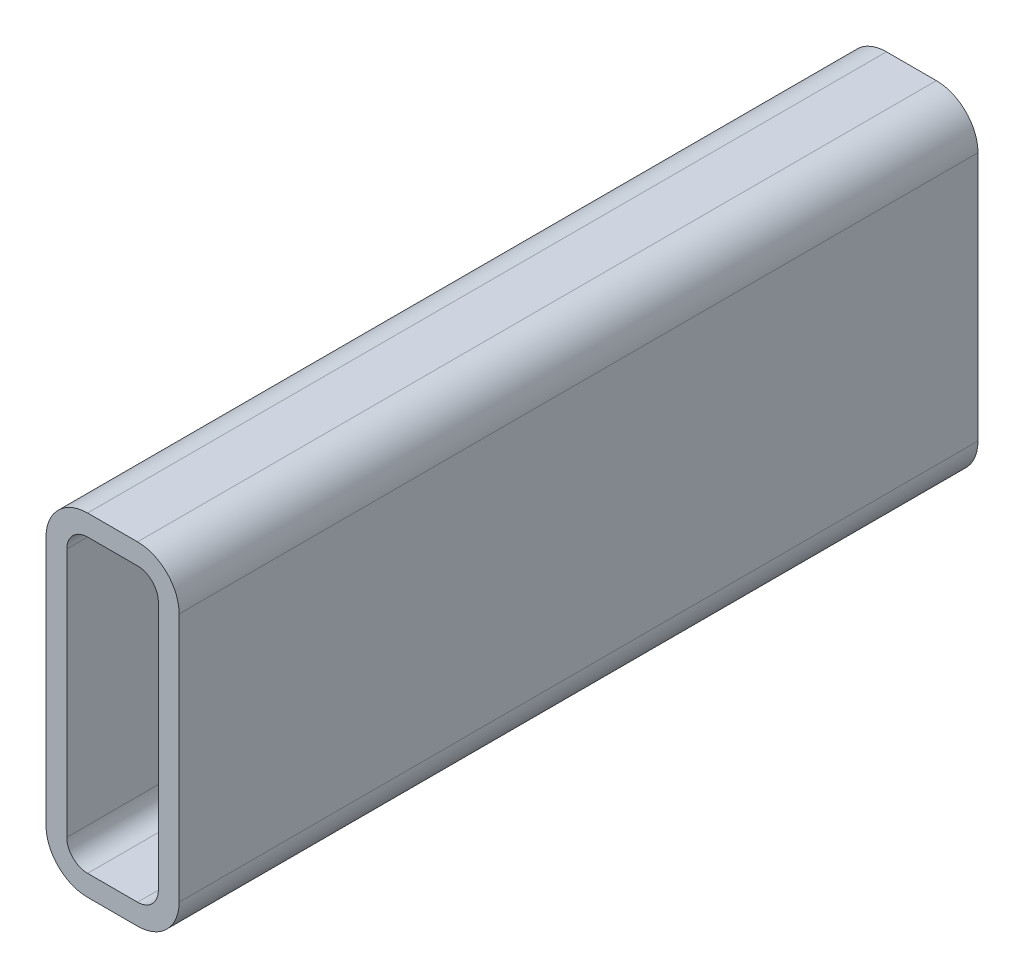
ISO-10303-21;
HEADER;
FILE_DESCRIPTION(('STEP AP214'),'2;1');
FILE_NAME('part.step','',(''),(''),'','','');
FILE_SCHEMA(('AUTOMOTIVE_DESIGN { 1 0 10303 214 1 1 1 1 }'));
ENDSEC;
DATA;
#1=APPLICATION_CONTEXT('core data for automotive mechanical design processes');
#2=APPLICATION_PROTOCOL_DEFINITION('international standard','automotive_design',2000,#1);
#3=PRODUCT_CONTEXT('',#1,'mechanical');
#4=PRODUCT('Part','Part','',(#3));
#5=PRODUCT_RELATED_PRODUCT_CATEGORY('part','',(#4));
#6=PRODUCT_DEFINITION_FORMATION('','',#4);
#7=PRODUCT_DEFINITION_CONTEXT('part definition',#1,'design');
#8=PRODUCT_DEFINITION('design','',#6,#7);
#9=PRODUCT_DEFINITION_SHAPE('','',#8);
#10=(LENGTH_UNIT() NAMED_UNIT(*) SI_UNIT(.MILLI.,.METRE.));
#11=(NAMED_UNIT(*) PLANE_ANGLE_UNIT() SI_UNIT($,.RADIAN.));
#12=(NAMED_UNIT(*) SI_UNIT($,.STERADIAN.) SOLID_ANGLE_UNIT());
#13=UNCERTAINTY_MEASURE_WITH_UNIT(LENGTH_MEASURE(1.E-05),#10,'distance_accuracy_value','');
#14=(GEOMETRIC_REPRESENTATION_CONTEXT(3) GLOBAL_UNCERTAINTY_ASSIGNED_CONTEXT((#13)) GLOBAL_UNIT_ASSIGNED_CONTEXT((#10,
#11,#12)) REPRESENTATION_CONTEXT('',''));
#15=CARTESIAN_POINT('',(0.,0.,0.));
#16=DIRECTION('',(0.,0.,1.));
#17=DIRECTION('',(1.,0.,0.));
#18=AXIS2_PLACEMENT_3D('',#15,#16,#17);
#19=CARTESIAN_POINT('',(15.875,111.125,304.8));
#20=DIRECTION('',(0.,0.,1.));
#21=DIRECTION('',(1.,0.,0.));
#22=AXIS2_PLACEMENT_3D('',#19,#20,#21);
#23=PLANE('',#22);
#24=CARTESIAN_POINT('',(15.875,111.125,304.8));
#25=DIRECTION('',(0.,0.,1.));
#26=DIRECTION('',(1.,0.,0.));
#27=AXIS2_PLACEMENT_3D('',#24,#25,#26);
#28=CIRCLE('',#27,15.875);
#29=CARTESIAN_POINT('',(15.875,127.,304.8));
#30=VERTEX_POINT('',#29);
#31=CARTESIAN_POINT('',(0.,111.125,304.8));
#32=VERTEX_POINT('',#31);
#33=EDGE_CURVE('E211',#30,#32,#28,.T.);
#34=ORIENTED_EDGE('',*,*,#33,.T.);
#35=DIRECTION('',(0.,-1.,0.));
#36=VECTOR('',#35,1.);
#37=CARTESIAN_POINT('',(0.,15.875,304.8));
#38=LINE('',#37,#36);
#39=CARTESIAN_POINT('',(0.,15.875,304.8));
#40=VERTEX_POINT('',#39);
#41=EDGE_CURVE('E214',#32,#40,#38,.T.);
#42=ORIENTED_EDGE('',*,*,#41,.T.);
#43=CARTESIAN_POINT('',(15.875,15.875,304.8));
#44=DIRECTION('',(0.,0.,1.));
#45=DIRECTION('',(1.,0.,0.));
#46=AXIS2_PLACEMENT_3D('',#43,#44,#45);
#47=CIRCLE('',#46,15.875);
#48=CARTESIAN_POINT('',(15.875,0.,304.8));
#49=VERTEX_POINT('',#48);
#50=EDGE_CURVE('E217',#40,#49,#47,.T.);
#51=ORIENTED_EDGE('',*,*,#50,.T.);
#52=DIRECTION('',(1.,0.,0.));
#53=VECTOR('',#52,1.);
#54=CARTESIAN_POINT('',(34.925,0.,304.8));
#55=LINE('',#54,#53);
#56=CARTESIAN_POINT('',(34.925,0.,304.8));
#57=VERTEX_POINT('',#56);
#58=EDGE_CURVE('E219',#49,#57,#55,.T.);
#59=ORIENTED_EDGE('',*,*,#58,.T.);
#60=CARTESIAN_POINT('',(34.925,15.875,304.8));
#61=DIRECTION('',(0.,0.,1.));
#62=DIRECTION('',(1.,0.,0.));
#63=AXIS2_PLACEMENT_3D('',#60,#61,#62);
#64=CIRCLE('',#63,15.875);
#65=CARTESIAN_POINT('',(50.8,15.875,304.8));
#66=VERTEX_POINT('',#65);
#67=EDGE_CURVE('E221',#57,#66,#64,.T.);
#68=ORIENTED_EDGE('',*,*,#67,.T.);
#69=DIRECTION('',(0.,1.,0.));
#70=VECTOR('',#69,1.);
#71=CARTESIAN_POINT('',(50.8,111.125,304.8));
#72=LINE('',#71,#70);
#73=CARTESIAN_POINT('',(50.8,111.125,304.8));
#74=VERTEX_POINT('',#73);
#75=EDGE_CURVE('E223',#66,#74,#72,.T.);
#76=ORIENTED_EDGE('',*,*,#75,.T.);
#77=CARTESIAN_POINT('',(34.925,111.125,304.8));
#78=DIRECTION('',(0.,0.,1.));
#79=DIRECTION('',(1.,0.,0.));
#80=AXIS2_PLACEMENT_3D('',#77,#78,#79);
#81=CIRCLE('',#80,15.875);
#82=CARTESIAN_POINT('',(34.925,127.,304.8));
#83=VERTEX_POINT('',#82);
#84=EDGE_CURVE('E225',#74,#83,#81,.T.);
#85=ORIENTED_EDGE('',*,*,#84,.T.);
#86=DIRECTION('',(-1.,0.,0.));
#87=VECTOR('',#86,1.);
#88=CARTESIAN_POINT('',(15.875,127.,304.8));
#89=LINE('',#88,#87);
#90=EDGE_CURVE('E227',#83,#30,#89,.T.);
#91=ORIENTED_EDGE('',*,*,#90,.T.);
#92=EDGE_LOOP('',(#34,#42,#51,#59,#68,#76,#85,#91));
#93=FACE_BOUND('',#92,.T.);
#94=DIRECTION('',(0.,-1.,0.));
#95=VECTOR('',#94,1.);
#96=CARTESIAN_POINT('',(7.9375,15.875,304.8));
#97=LINE('',#96,#95);
#98=CARTESIAN_POINT('',(7.9375,111.125,304.8));
#99=VERTEX_POINT('',#98);
#100=CARTESIAN_POINT('',(7.9375,15.875,304.8));
#101=VERTEX_POINT('',#100);
#102=EDGE_CURVE('E154',#99,#101,#97,.T.);
#103=ORIENTED_EDGE('',*,*,#102,.F.);
#104=CARTESIAN_POINT('',(15.875,111.125,304.8));
#105=DIRECTION('',(0.,0.,1.));
#106=DIRECTION('',(1.,0.,0.));
#107=AXIS2_PLACEMENT_3D('',#104,#105,#106);
#108=CIRCLE('',#107,7.93749999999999);
#109=CARTESIAN_POINT('',(15.875,119.0625,304.8));
#110=VERTEX_POINT('',#109);
#111=EDGE_CURVE('E146',#110,#99,#108,.T.);
#112=ORIENTED_EDGE('',*,*,#111,.F.);
#113=DIRECTION('',(-1.,0.,0.));
#114=VECTOR('',#113,1.);
#115=CARTESIAN_POINT('',(15.875,119.0625,304.8));
#116=LINE('',#115,#114);
#117=CARTESIAN_POINT('',(34.925,119.0625,304.8));
#118=VERTEX_POINT('',#117);
#119=EDGE_CURVE('E179',#118,#110,#116,.T.);
#120=ORIENTED_EDGE('',*,*,#119,.F.);
#121=CARTESIAN_POINT('',(34.925,111.125,304.8));
#122=DIRECTION('',(0.,0.,1.));
#123=DIRECTION('',(1.,0.,0.));
#124=AXIS2_PLACEMENT_3D('',#121,#122,#123);
#125=CIRCLE('',#124,7.93749999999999);
#126=CARTESIAN_POINT('',(42.8625,111.125,304.8));
#127=VERTEX_POINT('',#126);
#128=EDGE_CURVE('E177',#127,#118,#125,.T.);
#129=ORIENTED_EDGE('',*,*,#128,.F.);
#130=DIRECTION('',(0.,1.,0.));
#131=VECTOR('',#130,1.);
#132=CARTESIAN_POINT('',(42.8625,111.125,304.8));
#133=LINE('',#132,#131);
#134=CARTESIAN_POINT('',(42.8625,15.875,304.8));
#135=VERTEX_POINT('',#134);
#136=EDGE_CURVE('E175',#135,#127,#133,.T.);
#137=ORIENTED_EDGE('',*,*,#136,.F.);
#138=CARTESIAN_POINT('',(34.925,15.875,304.8));
#139=DIRECTION('',(0.,0.,1.));
#140=DIRECTION('',(1.,0.,0.));
#141=AXIS2_PLACEMENT_3D('',#138,#139,#140);
#142=CIRCLE('',#141,7.9375);
#143=CARTESIAN_POINT('',(34.925,7.9375,304.8));
#144=VERTEX_POINT('',#143);
#145=EDGE_CURVE('E173',#144,#135,#142,.T.);
#146=ORIENTED_EDGE('',*,*,#145,.F.);
#147=DIRECTION('',(1.,0.,0.));
#148=VECTOR('',#147,1.);
#149=CARTESIAN_POINT('',(34.925,7.9375,304.8));
#150=LINE('',#149,#148);
#151=CARTESIAN_POINT('',(15.875,7.9375,304.8));
#152=VERTEX_POINT('',#151);
#153=EDGE_CURVE('E169',#152,#144,#150,.T.);
#154=ORIENTED_EDGE('',*,*,#153,.F.);
#155=CARTESIAN_POINT('',(15.875,15.875,304.8));
#156=DIRECTION('',(0.,0.,1.));
#157=DIRECTION('',(1.,0.,0.));
#158=AXIS2_PLACEMENT_3D('',#155,#156,#157);
#159=CIRCLE('',#158,7.9375);
#160=EDGE_CURVE('E167',#101,#152,#159,.T.);
#161=ORIENTED_EDGE('',*,*,#160,.F.);
#162=EDGE_LOOP('',(#103,#112,#120,#129,#137,#146,#154,#161));
#163=FACE_BOUND('',#162,.T.);
#164=ADVANCED_FACE('F33',(#93,#163),#23,.T.);
#165=CARTESIAN_POINT('',(15.875,111.125,0.));
#166=DIRECTION('',(0.,0.,1.));
#167=DIRECTION('',(1.,0.,0.));
#168=AXIS2_PLACEMENT_3D('',#165,#166,#167);
#169=PLANE('',#168);
#170=CARTESIAN_POINT('',(15.875,111.125,0.));
#171=DIRECTION('',(0.,0.,1.));
#172=DIRECTION('',(1.,0.,0.));
#173=AXIS2_PLACEMENT_3D('',#170,#171,#172);
#174=CIRCLE('',#173,15.875);
#175=CARTESIAN_POINT('',(15.875,127.,0.));
#176=VERTEX_POINT('',#175);
#177=CARTESIAN_POINT('',(0.,111.125,0.));
#178=VERTEX_POINT('',#177);
#179=EDGE_CURVE('E162',#176,#178,#174,.T.);
#180=ORIENTED_EDGE('',*,*,#179,.F.);
#181=DIRECTION('',(-1.,0.,0.));
#182=VECTOR('',#181,1.);
#183=CARTESIAN_POINT('',(15.875,127.,0.));
#184=LINE('',#183,#182);
#185=CARTESIAN_POINT('',(34.925,127.,0.));
#186=VERTEX_POINT('',#185);
#187=EDGE_CURVE('E215',#186,#176,#184,.T.);
#188=ORIENTED_EDGE('',*,*,#187,.F.);
#189=CARTESIAN_POINT('',(34.925,111.125,0.));
#190=DIRECTION('',(0.,0.,1.));
#191=DIRECTION('',(1.,0.,0.));
#192=AXIS2_PLACEMENT_3D('',#189,#190,#191);
#193=CIRCLE('',#192,15.875);
#194=CARTESIAN_POINT('',(50.8,111.125,0.));
#195=VERTEX_POINT('',#194);
#196=EDGE_CURVE('E242',#195,#186,#193,.T.);
#197=ORIENTED_EDGE('',*,*,#196,.F.);
#198=DIRECTION('',(0.,1.,0.));
#199=VECTOR('',#198,1.);
#200=CARTESIAN_POINT('',(50.8,111.125,0.));
#201=LINE('',#200,#199);
#202=CARTESIAN_POINT('',(50.8,15.875,0.));
#203=VERTEX_POINT('',#202);
#204=EDGE_CURVE('E240',#203,#195,#201,.T.);
#205=ORIENTED_EDGE('',*,*,#204,.F.);
#206=CARTESIAN_POINT('',(34.925,15.875,0.));
#207=DIRECTION('',(0.,0.,1.));
#208=DIRECTION('',(1.,0.,0.));
#209=AXIS2_PLACEMENT_3D('',#206,#207,#208);
#210=CIRCLE('',#209,15.875);
#211=CARTESIAN_POINT('',(34.925,0.,0.));
#212=VERTEX_POINT('',#211);
#213=EDGE_CURVE('E238',#212,#203,#210,.T.);
#214=ORIENTED_EDGE('',*,*,#213,.F.);
#215=DIRECTION('',(1.,0.,0.));
#216=VECTOR('',#215,1.);
#217=CARTESIAN_POINT('',(34.925,0.,0.));
#218=LINE('',#217,#216);
#219=CARTESIAN_POINT('',(15.875,0.,0.));
#220=VERTEX_POINT('',#219);
#221=EDGE_CURVE('E236',#220,#212,#218,.T.);
#222=ORIENTED_EDGE('',*,*,#221,.F.);
#223=CARTESIAN_POINT('',(15.875,15.875,0.));
#224=DIRECTION('',(0.,0.,1.));
#225=DIRECTION('',(1.,0.,0.));
#226=AXIS2_PLACEMENT_3D('',#223,#224,#225);
#227=CIRCLE('',#226,15.875);
#228=CARTESIAN_POINT('',(0.,15.875,0.));
#229=VERTEX_POINT('',#228);
#230=EDGE_CURVE('E234',#229,#220,#227,.T.);
#231=ORIENTED_EDGE('',*,*,#230,.F.);
#232=DIRECTION('',(0.,-1.,0.));
#233=VECTOR('',#232,1.);
#234=CARTESIAN_POINT('',(0.,15.875,0.));
#235=LINE('',#234,#233);
#236=EDGE_CURVE('E232',#178,#229,#235,.T.);
#237=ORIENTED_EDGE('',*,*,#236,.F.);
#238=EDGE_LOOP('',(#180,#188,#197,#205,#214,#222,#231,#237));
#239=FACE_BOUND('',#238,.T.);
#240=CARTESIAN_POINT('',(15.875,111.125,0.));
#241=DIRECTION('',(0.,0.,1.));
#242=DIRECTION('',(1.,0.,0.));
#243=AXIS2_PLACEMENT_3D('',#240,#241,#242);
#244=CIRCLE('',#243,7.93749999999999);
#245=CARTESIAN_POINT('',(15.875,119.0625,0.));
#246=VERTEX_POINT('',#245);
#247=CARTESIAN_POINT('',(7.9375,111.125,0.));
#248=VERTEX_POINT('',#247);
#249=EDGE_CURVE('E56',#246,#248,#244,.T.);
#250=ORIENTED_EDGE('',*,*,#249,.T.);
#251=DIRECTION('',(0.,-1.,0.));
#252=VECTOR('',#251,1.);
#253=CARTESIAN_POINT('',(7.9375,15.875,0.));
#254=LINE('',#253,#252);
#255=CARTESIAN_POINT('',(7.9375,15.875,0.));
#256=VERTEX_POINT('',#255);
#257=EDGE_CURVE('E161',#248,#256,#254,.T.);
#258=ORIENTED_EDGE('',*,*,#257,.T.);
#259=CARTESIAN_POINT('',(15.875,15.875,0.));
#260=DIRECTION('',(0.,0.,1.));
#261=DIRECTION('',(1.,0.,0.));
#262=AXIS2_PLACEMENT_3D('',#259,#260,#261);
#263=CIRCLE('',#262,7.9375);
#264=CARTESIAN_POINT('',(15.875,7.9375,0.));
#265=VERTEX_POINT('',#264);
#266=EDGE_CURVE('E183',#256,#265,#263,.T.);
#267=ORIENTED_EDGE('',*,*,#266,.T.);
#268=DIRECTION('',(1.,0.,0.));
#269=VECTOR('',#268,1.);
#270=CARTESIAN_POINT('',(34.925,7.9375,0.));
#271=LINE('',#270,#269);
#272=CARTESIAN_POINT('',(34.925,7.9375,0.));
#273=VERTEX_POINT('',#272);
#274=EDGE_CURVE('E186',#265,#273,#271,.T.);
#275=ORIENTED_EDGE('',*,*,#274,.T.);
#276=CARTESIAN_POINT('',(34.925,15.875,0.));
#277=DIRECTION('',(0.,0.,1.));
#278=DIRECTION('',(1.,0.,0.));
#279=AXIS2_PLACEMENT_3D('',#276,#277,#278);
#280=CIRCLE('',#279,7.9375);
#281=CARTESIAN_POINT('',(42.8625,15.875,0.));
#282=VERTEX_POINT('',#281);
#283=EDGE_CURVE('E189',#273,#282,#280,.T.);
#284=ORIENTED_EDGE('',*,*,#283,.T.);
#285=DIRECTION('',(0.,1.,0.));
#286=VECTOR('',#285,1.);
#287=CARTESIAN_POINT('',(42.8625,111.125,0.));
#288=LINE('',#287,#286);
#289=CARTESIAN_POINT('',(42.8625,111.125,0.));
#290=VERTEX_POINT('',#289);
#291=EDGE_CURVE('E192',#282,#290,#288,.T.);
#292=ORIENTED_EDGE('',*,*,#291,.T.);
#293=CARTESIAN_POINT('',(34.925,111.125,0.));
#294=DIRECTION('',(0.,0.,1.));
#295=DIRECTION('',(1.,0.,0.));
#296=AXIS2_PLACEMENT_3D('',#293,#294,#295);
#297=CIRCLE('',#296,7.93749999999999);
#298=CARTESIAN_POINT('',(34.925,119.0625,0.));
#299=VERTEX_POINT('',#298);
#300=EDGE_CURVE('E195',#290,#299,#297,.T.);
#301=ORIENTED_EDGE('',*,*,#300,.T.);
#302=DIRECTION('',(-1.,0.,0.));
#303=VECTOR('',#302,1.);
#304=CARTESIAN_POINT('',(15.875,119.0625,0.));
#305=LINE('',#304,#303);
#306=EDGE_CURVE('E155',#299,#246,#305,.T.);
#307=ORIENTED_EDGE('',*,*,#306,.T.);
#308=EDGE_LOOP('',(#250,#258,#267,#275,#284,#292,#301,#307));
#309=FACE_BOUND('',#308,.T.);
#310=ADVANCED_FACE('F272',(#239,#309),#169,.F.);
#311=CARTESIAN_POINT('',(15.875,111.125,304.8));
#312=DIRECTION('',(0.,0.,-1.));
#313=DIRECTION('',(-1.,0.,0.));
#314=AXIS2_PLACEMENT_3D('',#311,#312,#313);
#315=CYLINDRICAL_SURFACE('',#314,15.875);
#316=ORIENTED_EDGE('',*,*,#179,.T.);
#317=DIRECTION('',(0.,0.,-1.));
#318=VECTOR('',#317,1.);
#319=CARTESIAN_POINT('',(0.,111.125,304.8));
#320=LINE('',#319,#318);
#321=EDGE_CURVE('E11',#32,#178,#320,.T.);
#322=ORIENTED_EDGE('',*,*,#321,.F.);
#323=ORIENTED_EDGE('',*,*,#33,.F.);
#324=DIRECTION('',(0.,0.,-1.));
#325=VECTOR('',#324,1.);
#326=CARTESIAN_POINT('',(15.875,127.,304.8));
#327=LINE('',#326,#325);
#328=EDGE_CURVE('E229',#30,#176,#327,.T.);
#329=ORIENTED_EDGE('',*,*,#328,.T.);
#330=EDGE_LOOP('',(#316,#322,#323,#329));
#331=FACE_BOUND('',#330,.T.);
#332=ADVANCED_FACE('F35',(#331),#315,.T.);
#333=CARTESIAN_POINT('',(0.,15.875,304.8));
#334=DIRECTION('',(1.,0.,0.));
#335=DIRECTION('',(0.,0.,-1.));
#336=AXIS2_PLACEMENT_3D('',#333,#334,#335);
#337=PLANE('',#336);
#338=ORIENTED_EDGE('',*,*,#236,.T.);
#339=DIRECTION('',(0.,0.,-1.));
#340=VECTOR('',#339,1.);
#341=CARTESIAN_POINT('',(0.,15.875,304.8));
#342=LINE('',#341,#340);
#343=EDGE_CURVE('E41',#40,#229,#342,.T.);
#344=ORIENTED_EDGE('',*,*,#343,.F.);
#345=ORIENTED_EDGE('',*,*,#41,.F.);
#346=ORIENTED_EDGE('',*,*,#321,.T.);
#347=EDGE_LOOP('',(#338,#344,#345,#346));
#348=FACE_BOUND('',#347,.T.);
#349=ADVANCED_FACE('F289',(#348),#337,.F.);
#350=CARTESIAN_POINT('',(15.875,15.875,304.8));
#351=DIRECTION('',(0.,0.,-1.));
#352=DIRECTION('',(-1.,0.,0.));
#353=AXIS2_PLACEMENT_3D('',#350,#351,#352);
#354=CYLINDRICAL_SURFACE('',#353,15.875);
#355=ORIENTED_EDGE('',*,*,#230,.T.);
#356=DIRECTION('',(0.,0.,-1.));
#357=VECTOR('',#356,1.);
#358=CARTESIAN_POINT('',(15.875,0.,304.8));
#359=LINE('',#358,#357);
#360=EDGE_CURVE('E259',#49,#220,#359,.T.);
#361=ORIENTED_EDGE('',*,*,#360,.F.);
#362=ORIENTED_EDGE('',*,*,#50,.F.);
#363=ORIENTED_EDGE('',*,*,#343,.T.);
#364=EDGE_LOOP('',(#355,#361,#362,#363));
#365=FACE_BOUND('',#364,.T.);
#366=ADVANCED_FACE('F266',(#365),#354,.T.);
#367=CARTESIAN_POINT('',(34.925,0.,304.8));
#368=DIRECTION('',(0.,1.,0.));
#369=DIRECTION('',(0.,0.,1.));
#370=AXIS2_PLACEMENT_3D('',#367,#368,#369);
#371=PLANE('',#370);
#372=ORIENTED_EDGE('',*,*,#221,.T.);
#373=DIRECTION('',(0.,0.,-1.));
#374=VECTOR('',#373,1.);
#375=CARTESIAN_POINT('',(34.925,0.,304.8));
#376=LINE('',#375,#374);
#377=EDGE_CURVE('E256',#57,#212,#376,.T.);
#378=ORIENTED_EDGE('',*,*,#377,.F.);
#379=ORIENTED_EDGE('',*,*,#58,.F.);
#380=ORIENTED_EDGE('',*,*,#360,.T.);
#381=EDGE_LOOP('',(#372,#378,#379,#380));
#382=FACE_BOUND('',#381,.T.);
#383=ADVANCED_FACE('F278',(#382),#371,.F.);
#384=CARTESIAN_POINT('',(34.925,15.875,304.8));
#385=DIRECTION('',(0.,0.,-1.));
#386=DIRECTION('',(-1.,0.,0.));
#387=AXIS2_PLACEMENT_3D('',#384,#385,#386);
#388=CYLINDRICAL_SURFACE('',#387,15.875);
#389=ORIENTED_EDGE('',*,*,#213,.T.);
#390=DIRECTION('',(0.,0.,-1.));
#391=VECTOR('',#390,1.);
#392=CARTESIAN_POINT('',(50.8,15.875,304.8));
#393=LINE('',#392,#391);
#394=EDGE_CURVE('E253',#66,#203,#393,.T.);
#395=ORIENTED_EDGE('',*,*,#394,.F.);
#396=ORIENTED_EDGE('',*,*,#67,.F.);
#397=ORIENTED_EDGE('',*,*,#377,.T.);
#398=EDGE_LOOP('',(#389,#395,#396,#397));
#399=FACE_BOUND('',#398,.T.);
#400=ADVANCED_FACE('F282',(#399),#388,.T.);
#401=CARTESIAN_POINT('',(50.8,111.125,304.8));
#402=DIRECTION('',(-1.,0.,0.));
#403=DIRECTION('',(0.,0.,1.));
#404=AXIS2_PLACEMENT_3D('',#401,#402,#403);
#405=PLANE('',#404);
#406=ORIENTED_EDGE('',*,*,#204,.T.);
#407=DIRECTION('',(0.,0.,-1.));
#408=VECTOR('',#407,1.);
#409=CARTESIAN_POINT('',(50.8,111.125,304.8));
#410=LINE('',#409,#408);
#411=EDGE_CURVE('E250',#74,#195,#410,.T.);
#412=ORIENTED_EDGE('',*,*,#411,.F.);
#413=ORIENTED_EDGE('',*,*,#75,.F.);
#414=ORIENTED_EDGE('',*,*,#394,.T.);
#415=EDGE_LOOP('',(#406,#412,#413,#414));
#416=FACE_BOUND('',#415,.T.);
#417=ADVANCED_FACE('F302',(#416),#405,.F.);
#418=CARTESIAN_POINT('',(34.925,111.125,304.8));
#419=DIRECTION('',(0.,0.,-1.));
#420=DIRECTION('',(-1.,0.,0.));
#421=AXIS2_PLACEMENT_3D('',#418,#419,#420);
#422=CYLINDRICAL_SURFACE('',#421,15.875);
#423=ORIENTED_EDGE('',*,*,#196,.T.);
#424=DIRECTION('',(0.,0.,-1.));
#425=VECTOR('',#424,1.);
#426=CARTESIAN_POINT('',(34.925,127.,304.8));
#427=LINE('',#426,#425);
#428=EDGE_CURVE('E247',#83,#186,#427,.T.);
#429=ORIENTED_EDGE('',*,*,#428,.F.);
#430=ORIENTED_EDGE('',*,*,#84,.F.);
#431=ORIENTED_EDGE('',*,*,#411,.T.);
#432=EDGE_LOOP('',(#423,#429,#430,#431));
#433=FACE_BOUND('',#432,.T.);
#434=ADVANCED_FACE('F300',(#433),#422,.T.);
#435=CARTESIAN_POINT('',(15.875,127.,304.8));
#436=DIRECTION('',(0.,-1.,0.));
#437=DIRECTION('',(0.,0.,-1.));
#438=AXIS2_PLACEMENT_3D('',#435,#436,#437);
#439=PLANE('',#438);
#440=ORIENTED_EDGE('',*,*,#187,.T.);
#441=ORIENTED_EDGE('',*,*,#328,.F.);
#442=ORIENTED_EDGE('',*,*,#90,.F.);
#443=ORIENTED_EDGE('',*,*,#428,.T.);
#444=EDGE_LOOP('',(#440,#441,#442,#443));
#445=FACE_BOUND('',#444,.T.);
#446=ADVANCED_FACE('F295',(#445),#439,.F.);
#447=CARTESIAN_POINT('',(15.875,111.125,304.8));
#448=DIRECTION('',(0.,0.,-1.));
#449=DIRECTION('',(-1.,0.,0.));
#450=AXIS2_PLACEMENT_3D('',#447,#448,#449);
#451=CYLINDRICAL_SURFACE('',#450,7.93749999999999);
#452=ORIENTED_EDGE('',*,*,#249,.F.);
#453=DIRECTION('',(0.,0.,-1.));
#454=VECTOR('',#453,1.);
#455=CARTESIAN_POINT('',(15.875,119.0625,304.8));
#456=LINE('',#455,#454);
#457=EDGE_CURVE('E150',#110,#246,#456,.T.);
#458=ORIENTED_EDGE('',*,*,#457,.F.);
#459=ORIENTED_EDGE('',*,*,#111,.T.);
#460=DIRECTION('',(0.,0.,-1.));
#461=VECTOR('',#460,1.);
#462=CARTESIAN_POINT('',(7.9375,111.125,304.8));
#463=LINE('',#462,#461);
#464=EDGE_CURVE('E149',#99,#248,#463,.T.);
#465=ORIENTED_EDGE('',*,*,#464,.T.);
#466=EDGE_LOOP('',(#452,#458,#459,#465));
#467=FACE_BOUND('',#466,.T.);
#468=ADVANCED_FACE('F148',(#467),#451,.F.);
#469=CARTESIAN_POINT('',(7.9375,15.875,304.8));
#470=DIRECTION('',(1.,0.,0.));
#471=DIRECTION('',(0.,0.,-1.));
#472=AXIS2_PLACEMENT_3D('',#469,#470,#471);
#473=PLANE('',#472);
#474=ORIENTED_EDGE('',*,*,#257,.F.);
#475=ORIENTED_EDGE('',*,*,#464,.F.);
#476=ORIENTED_EDGE('',*,*,#102,.T.);
#477=DIRECTION('',(0.,0.,-1.));
#478=VECTOR('',#477,1.);
#479=CARTESIAN_POINT('',(7.9375,15.875,304.8));
#480=LINE('',#479,#478);
#481=EDGE_CURVE('E163',#101,#256,#480,.T.);
#482=ORIENTED_EDGE('',*,*,#481,.T.);
#483=EDGE_LOOP('',(#474,#475,#476,#482));
#484=FACE_BOUND('',#483,.T.);
#485=ADVANCED_FACE('F158',(#484),#473,.T.);
#486=CARTESIAN_POINT('',(15.875,15.875,304.8));
#487=DIRECTION('',(0.,0.,-1.));
#488=DIRECTION('',(-1.,0.,0.));
#489=AXIS2_PLACEMENT_3D('',#486,#487,#488);
#490=CYLINDRICAL_SURFACE('',#489,7.9375);
#491=ORIENTED_EDGE('',*,*,#266,.F.);
#492=ORIENTED_EDGE('',*,*,#481,.F.);
#493=ORIENTED_EDGE('',*,*,#160,.T.);
#494=DIRECTION('',(0.,0.,-1.));
#495=VECTOR('',#494,1.);
#496=CARTESIAN_POINT('',(15.875,7.9375,304.8));
#497=LINE('',#496,#495);
#498=EDGE_CURVE('E208',#152,#265,#497,.T.);
#499=ORIENTED_EDGE('',*,*,#498,.T.);
#500=EDGE_LOOP('',(#491,#492,#493,#499));
#501=FACE_BOUND('',#500,.T.);
#502=ADVANCED_FACE('F327',(#501),#490,.F.);
#503=CARTESIAN_POINT('',(34.925,7.9375,304.8));
#504=DIRECTION('',(0.,1.,0.));
#505=DIRECTION('',(0.,0.,1.));
#506=AXIS2_PLACEMENT_3D('',#503,#504,#505);
#507=PLANE('',#506);
#508=ORIENTED_EDGE('',*,*,#274,.F.);
#509=ORIENTED_EDGE('',*,*,#498,.F.);
#510=ORIENTED_EDGE('',*,*,#153,.T.);
#511=DIRECTION('',(0.,0.,-1.));
#512=VECTOR('',#511,1.);
#513=CARTESIAN_POINT('',(34.925,7.9375,304.8));
#514=LINE('',#513,#512);
#515=EDGE_CURVE('E206',#144,#273,#514,.T.);
#516=ORIENTED_EDGE('',*,*,#515,.T.);
#517=EDGE_LOOP('',(#508,#509,#510,#516));
#518=FACE_BOUND('',#517,.T.);
#519=ADVANCED_FACE('F331',(#518),#507,.T.);
#520=CARTESIAN_POINT('',(34.925,15.875,304.8));
#521=DIRECTION('',(0.,0.,-1.));
#522=DIRECTION('',(-1.,0.,0.));
#523=AXIS2_PLACEMENT_3D('',#520,#521,#522);
#524=CYLINDRICAL_SURFACE('',#523,7.9375);
#525=ORIENTED_EDGE('',*,*,#283,.F.);
#526=ORIENTED_EDGE('',*,*,#515,.F.);
#527=ORIENTED_EDGE('',*,*,#145,.T.);
#528=DIRECTION('',(0.,0.,-1.));
#529=VECTOR('',#528,1.);
#530=CARTESIAN_POINT('',(42.8625,15.875,304.8));
#531=LINE('',#530,#529);
#532=EDGE_CURVE('E204',#135,#282,#531,.T.);
#533=ORIENTED_EDGE('',*,*,#532,.T.);
#534=EDGE_LOOP('',(#525,#526,#527,#533));
#535=FACE_BOUND('',#534,.T.);
#536=ADVANCED_FACE('F337',(#535),#524,.F.);
#537=CARTESIAN_POINT('',(42.8625,111.125,304.8));
#538=DIRECTION('',(-1.,0.,0.));
#539=DIRECTION('',(0.,0.,1.));
#540=AXIS2_PLACEMENT_3D('',#537,#538,#539);
#541=PLANE('',#540);
#542=ORIENTED_EDGE('',*,*,#291,.F.);
#543=ORIENTED_EDGE('',*,*,#532,.F.);
#544=ORIENTED_EDGE('',*,*,#136,.T.);
#545=DIRECTION('',(0.,0.,-1.));
#546=VECTOR('',#545,1.);
#547=CARTESIAN_POINT('',(42.8625,111.125,304.8));
#548=LINE('',#547,#546);
#549=EDGE_CURVE('E202',#127,#290,#548,.T.);
#550=ORIENTED_EDGE('',*,*,#549,.T.);
#551=EDGE_LOOP('',(#542,#543,#544,#550));
#552=FACE_BOUND('',#551,.T.);
#553=ADVANCED_FACE('F341',(#552),#541,.T.);
#554=CARTESIAN_POINT('',(34.925,111.125,304.8));
#555=DIRECTION('',(0.,0.,-1.));
#556=DIRECTION('',(-1.,0.,0.));
#557=AXIS2_PLACEMENT_3D('',#554,#555,#556);
#558=CYLINDRICAL_SURFACE('',#557,7.93749999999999);
#559=ORIENTED_EDGE('',*,*,#300,.F.);
#560=ORIENTED_EDGE('',*,*,#549,.F.);
#561=ORIENTED_EDGE('',*,*,#128,.T.);
#562=DIRECTION('',(0.,0.,-1.));
#563=VECTOR('',#562,1.);
#564=CARTESIAN_POINT('',(34.925,119.0625,304.8));
#565=LINE('',#564,#563);
#566=EDGE_CURVE('E48',#118,#299,#565,.T.);
#567=ORIENTED_EDGE('',*,*,#566,.T.);
#568=EDGE_LOOP('',(#559,#560,#561,#567));
#569=FACE_BOUND('',#568,.T.);
#570=ADVANCED_FACE('F345',(#569),#558,.F.);
#571=CARTESIAN_POINT('',(15.875,119.0625,304.8));
#572=DIRECTION('',(0.,-1.,0.));
#573=DIRECTION('',(0.,0.,-1.));
#574=AXIS2_PLACEMENT_3D('',#571,#572,#573);
#575=PLANE('',#574);
#576=ORIENTED_EDGE('',*,*,#306,.F.);
#577=ORIENTED_EDGE('',*,*,#566,.F.);
#578=ORIENTED_EDGE('',*,*,#119,.T.);
#579=ORIENTED_EDGE('',*,*,#457,.T.);
#580=EDGE_LOOP('',(#576,#577,#578,#579));
#581=FACE_BOUND('',#580,.T.);
#582=ADVANCED_FACE('F349',(#581),#575,.T.);
#583=CLOSED_SHELL('',(#164,#310,#332,#349,#366,#383,#400,#417,#434,#446,#468,#485,#502,#519,
#536,#553,#570,#582));
#584=MANIFOLD_SOLID_BREP('B2',#583);
#585=ADVANCED_BREP_SHAPE_REPRESENTATION('',(#18,#584),#14);
#586=SHAPE_DEFINITION_REPRESENTATION(#9,#585);
ENDSEC;
END-ISO-10303-21;
